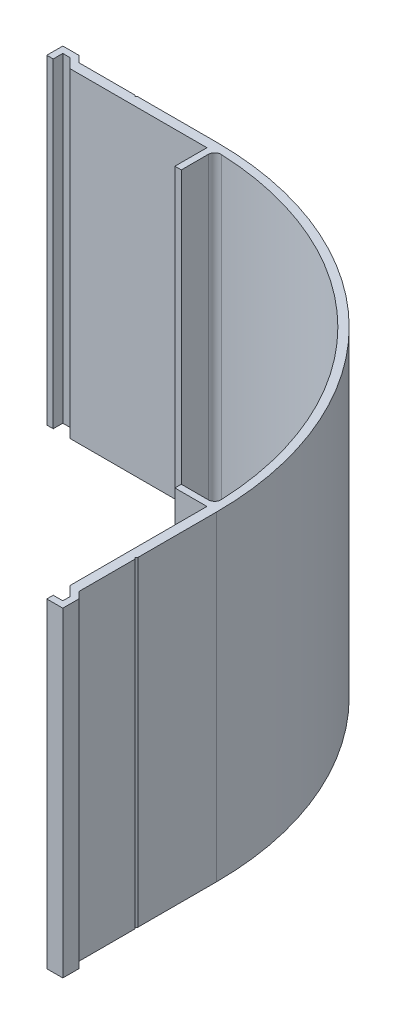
from build123d import *

# Parameters (mm, degrees)
EXTRUDE1_DEPTH = 50


with BuildPart() as part:
    # Sketch1 → Extrude1 (new, symmetric)
    with BuildSketch(Plane(origin=(0, 0, 0), x_dir=(1, 0, 0), z_dir=(0, 1, 0))):
        with BuildLine():
            Line((3, 50), (3, 25.4))
            Line((3, 25.4), (2.6, 25))
            Line((2.6, 25), (3, 24.6))
            Line((3, 24.6), (3, 7))
            Line((3, 7), (5, 5))
            Line((5, 5), (5, 0))
            Line((5, 0), (0, 0))
            Line((0, 0), (0, 2))
            Line((0, 2), (3, 2))
            Line((3, 2), (3, 4.171572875))
            Line((3, 4.171572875), (0, 7.171572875))
            Line((0, 7.171572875), (0, 50))
            Line((0, 50), (-10, 50))
            Line((-10, 50), (-10, 52))
            Line((-10, 52), (-1.583806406, 52))
            ThreePointArc((-1.583806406, 52), (-0.140279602, 52.615720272), (0.414438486, 54.083769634))
            ThreePointArc((0.414438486, 54.083769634), (-28.057088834, 118.942911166), (-92.916230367, 147.414438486))
            ThreePointArc((-92.916230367, 147.414438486), (-94.384279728, 146.859720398), (-95, 145.416193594))
            Line((-95, 145.416193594), (-95, 137))
            Line((-95, 137), (-97, 137))
            Line((-97, 137), (-97, 147))
            Line((-97, 147), (-139.828427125, 147))
            Line((-139.828427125, 147), (-142.828427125, 150))
            Line((-142.828427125, 150), (-145, 150))
            Line((-145, 150), (-145, 147))
            Line((-145, 147), (-147, 147))
            Line((-147, 147), (-147, 152))
            Line((-147, 152), (-142, 152))
            Line((-142, 152), (-140, 150))
            Line((-140, 150), (-122.4, 150))
            Line((-122.4, 150), (-122, 149.6))
            Line((-122, 149.6), (-121.6, 150))
            Line((-121.6, 150), (-97, 150))
            ThreePointArc((-97, 150), (-26.289321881, 120.710678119), (3, 50))
        make_face()
    extrude(amount=EXTRUDE1_DEPTH, both=True)


solid = part.part
